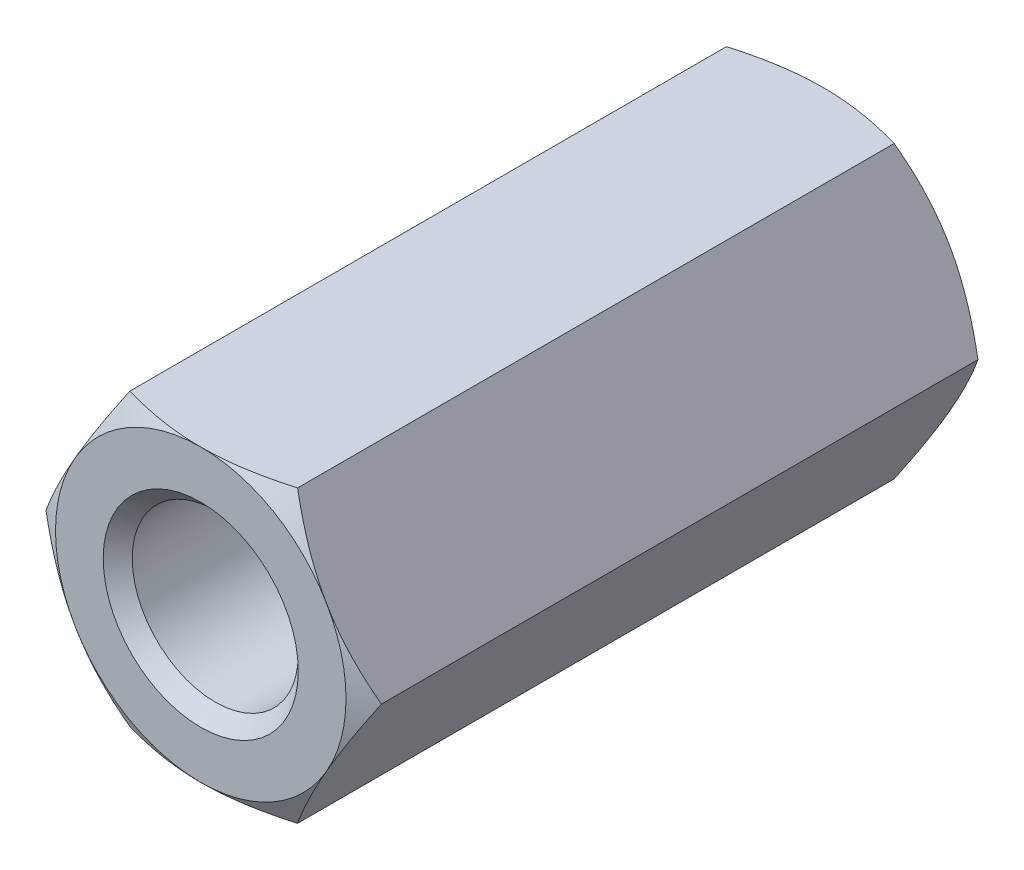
from build123d import *

# Parameters (mm, degrees)
BOSS_EXTRUDE1_DEPTH      = 7.5
SKETCH2_OUTSIDE_W        = 48.064
SKETCH2_OUTSIDE_H        = 46.982
SKETCH2_OUTSIDE_R        = 3.5
CUT_EXTRUDE1_DEPTH       = 10.210501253
CUT_EXTRUDE1_DRAFT       = -60
SKETCH3_R                = 2
SKETCH3_R_2              = 1.65
CUT_EXTRUDE2_DEPTH       = 7.5
SKETCH3_2_R              = 1.65
CUT_EXTRUDE3_DEPTH       = 8.55
CHAMFER1_SIZE            = 0.35
MIRROR1_COPY_1_SKETCH_W  = 48.064
MIRROR1_COPY_1_SKETCH_H  = 46.982
MIRROR1_COPY_1_SKETCH_R  = 3.5
MIRROR1_COPY_1_DEPTH     = 10.210501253
MIRROR1_COPY_1_DRAFT     = -60
CHAMFER1_OF_MIRROR1_SIZE = 0.35


with BuildPart() as part:
    # Sketch1 → Boss-Extrude1 (new body)
    with BuildSketch(Plane.XY):
        Polygon((2.020725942, 3.5), (-2.020725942, 3.5), (-4.041451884, 0), (-2.020725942, -3.5), (2.020725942, -3.5), (4.041451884, 0), align=None)
    boss_extrude1 = extrude(amount=-BOSS_EXTRUDE1_DEPTH)


with BuildPart() as cut_extrude1_tool:
    # Sketch2 outside → Cut-Extrude1 (with draft: the straight prism first)
    with BuildSketch(Plane(origin=(0, 0, -7.5), x_dir=(-1, 0, 0), z_dir=(0, 0, -1))):
        Rectangle(SKETCH2_OUTSIDE_W, SKETCH2_OUTSIDE_H)
        Circle(SKETCH2_OUTSIDE_R, mode=Mode.SUBTRACT)
    extrude(amount=-CUT_EXTRUDE1_DEPTH)
    # Cut-Extrude1: the draft: its side faces are tilted about the plane it starts from
    cut_extrude1_sides = [cut_extrude1_tool.faces().sort_by_distance(p)[0] for p in [
        (0, -23.491, -2.394749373),
        (-24.032, 0, -2.394749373),
        (0, 23.491, -2.394749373),
        (24.032, 0, -2.394749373),
        (3.5, 0, -2.394749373),
    ]]
    draft(cut_extrude1_sides, Plane(origin=(0, 0, -7.5), x_dir=(-1, 0, 0), z_dir=(0, 0, -1)), CUT_EXTRUDE1_DRAFT)


with BuildPart() as part_1:
    add(part.part)

    # Cut-Extrude1: cut by cut_extrude1_tool
    add(cut_extrude1_tool.part, mode=Mode.SUBTRACT)

    # Sketch3 → Cut-Extrude2 (cut)
    with BuildSketch(Plane(origin=(0, 0, -7.5), x_dir=(-1, 0, 0), z_dir=(0, 0, -1))):
        Circle(SKETCH3_R)
        Circle(SKETCH3_R_2, mode=Mode.SUBTRACT)
    cut_extrude2 = extrude(amount=-CUT_EXTRUDE2_DEPTH, mode=Mode.SUBTRACT)


with BuildPart() as cut_extrude2_piece_1:
    # of the separate pieces the step leaves, piece 1, a body of its own (cut_extrude2_pieces)
    add(part_1.part.solids().sort_by_distance((2.020725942, 3.5, 0))[0])

    # Chamfer1
    chamfer1_edges = [cut_extrude2_piece_1.edges().sort_by_distance(p)[0] for p in [
        (2, 0, -7.5),
    ]]
    chamfer(chamfer1_edges, length=CHAMFER1_SIZE)


with BuildPart() as cut_extrude2_piece_2:
    # of the separate pieces the step leaves, piece 2, a body of its own (cut_extrude2_pieces)
    add(part_1.part.solids().sort_by_distance((-1.65, 0, 0))[0])

    # Sketch3_2 → Cut-Extrude3 (cut)
    with BuildSketch(Plane(origin=(0, 0, -7.5), x_dir=(-1, 0, 0), z_dir=(0, 0, -1))):
        Circle(SKETCH3_2_R)
    cut_extrude3 = extrude(amount=-CUT_EXTRUDE3_DEPTH, mode=Mode.SUBTRACT)


with BuildPart() as cut_extrude2_piece_1_1:
    add(cut_extrude2_piece_1.part)

    # Mirror1: Boss-Extrude1, Cut-Extrude2, Cut-Extrude3 across plane
    add(boss_extrude1.mirror(Plane.XY))
    add(cut_extrude2.mirror(Plane.XY), mode=Mode.SUBTRACT)
    add(cut_extrude3.mirror(Plane.XY), mode=Mode.SUBTRACT)


with BuildPart() as mirror1_copy_1_tool:
    # Mirror1 copy 1 sketch → Mirror1 copy 1 (with draft: the straight prism first)
    with BuildSketch(Plane(origin=(0, 0, 7.5), x_dir=(-1, 0, 0), z_dir=(0, 0, 1))):
        Rectangle(MIRROR1_COPY_1_SKETCH_W, MIRROR1_COPY_1_SKETCH_H)
        Circle(MIRROR1_COPY_1_SKETCH_R, mode=Mode.SUBTRACT)
    extrude(amount=-MIRROR1_COPY_1_DEPTH)
    # Mirror1 copy 1: the draft: its side faces are tilted about the plane it starts from
    mirror1_copy_1_sides = [mirror1_copy_1_tool.faces().sort_by_distance(p)[0] for p in [
        (0, -23.491, 2.394749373),
        (-24.032, 0, 2.394749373),
        (0, 23.491, 2.394749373),
        (24.032, 0, 2.394749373),
        (3.5, 0, 2.394749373),
    ]]
    draft(mirror1_copy_1_sides, Plane(origin=(0, 0, 7.5), x_dir=(-1, 0, 0), z_dir=(0, 0, 1)), MIRROR1_COPY_1_DRAFT)


with BuildPart() as cut_extrude2_piece_1_2:
    add(cut_extrude2_piece_1_1.part)

    # Mirror1 copy 1: cut by mirror1_copy_1_tool
    add(mirror1_copy_1_tool.part, mode=Mode.SUBTRACT)

    # Chamfer1 of Mirror1
    chamfer1_of_mirror1_edges = [cut_extrude2_piece_1_2.edges().sort_by_distance(p)[0] for p in [
        (2, 0, 7.5),
    ]]
    chamfer(chamfer1_of_mirror1_edges, length=CHAMFER1_OF_MIRROR1_SIZE)


solid = cut_extrude2_piece_1_2.part
